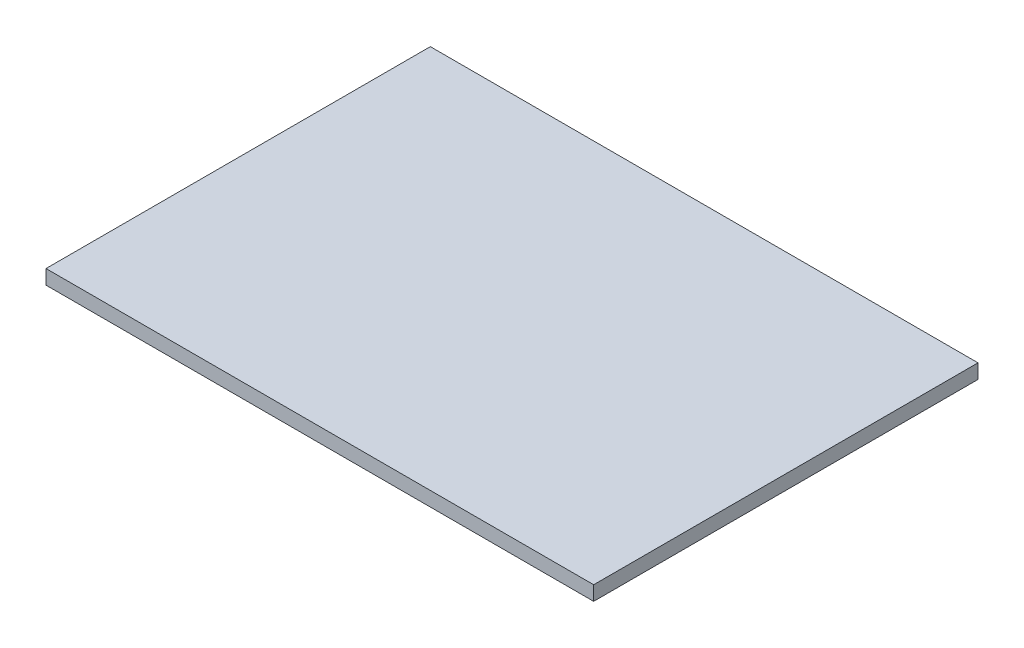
from build123d import *

# Parameters (mm, degrees)
SKETCH1_W           = 180.975
SKETCH1_H           = 127
BOSS_EXTRUDE1_DEPTH = 4.7625


with BuildPart() as part:
    # Sketch1 → Boss-Extrude1 (new body)
    with BuildSketch(Plane(origin=(0, 0, 0), x_dir=(1, 0, 0), z_dir=(0, 1, 0))):
        with Locations((90.4875, 63.5)):
            Rectangle(SKETCH1_W, SKETCH1_H)
    extrude(amount=BOSS_EXTRUDE1_DEPTH)


solid = part.part
